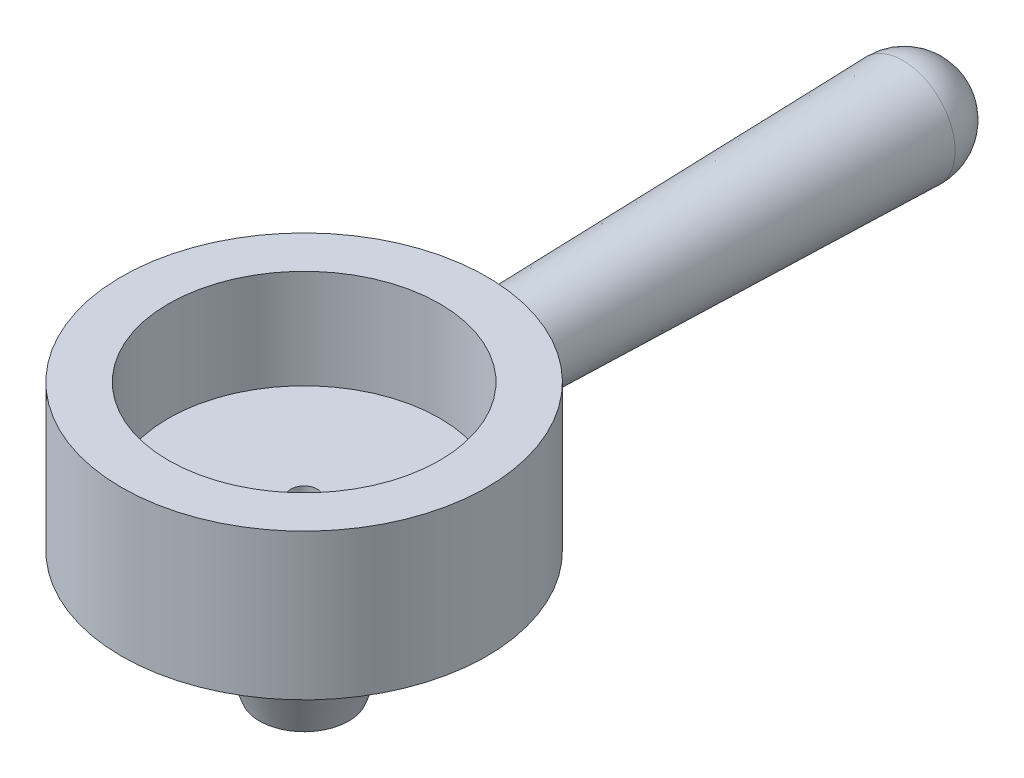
ISO-10303-21;
HEADER;
FILE_DESCRIPTION(('STEP AP214'),'2;1');
FILE_NAME('part.step','',(''),(''),'','','');
FILE_SCHEMA(('AUTOMOTIVE_DESIGN { 1 0 10303 214 1 1 1 1 }'));
ENDSEC;
DATA;
#1=APPLICATION_CONTEXT('core data for automotive mechanical design processes');
#2=APPLICATION_PROTOCOL_DEFINITION('international standard','automotive_design',2000,#1);
#3=PRODUCT_CONTEXT('',#1,'mechanical');
#4=PRODUCT('Part','Part','',(#3));
#5=PRODUCT_RELATED_PRODUCT_CATEGORY('part','',(#4));
#6=PRODUCT_DEFINITION_FORMATION('','',#4);
#7=PRODUCT_DEFINITION_CONTEXT('part definition',#1,'design');
#8=PRODUCT_DEFINITION('design','',#6,#7);
#9=PRODUCT_DEFINITION_SHAPE('','',#8);
#10=(LENGTH_UNIT() NAMED_UNIT(*) SI_UNIT(.MILLI.,.METRE.));
#11=(NAMED_UNIT(*) PLANE_ANGLE_UNIT() SI_UNIT($,.RADIAN.));
#12=(NAMED_UNIT(*) SI_UNIT($,.STERADIAN.) SOLID_ANGLE_UNIT());
#13=UNCERTAINTY_MEASURE_WITH_UNIT(LENGTH_MEASURE(1.E-05),#10,'distance_accuracy_value','');
#14=(GEOMETRIC_REPRESENTATION_CONTEXT(3) GLOBAL_UNCERTAINTY_ASSIGNED_CONTEXT((#13)) GLOBAL_UNIT_ASSIGNED_CONTEXT((#10,
#11,#12)) REPRESENTATION_CONTEXT('',''));
#15=CARTESIAN_POINT('',(0.,0.,0.));
#16=DIRECTION('',(0.,0.,1.));
#17=DIRECTION('',(1.,0.,0.));
#18=AXIS2_PLACEMENT_3D('',#15,#16,#17);
#19=CARTESIAN_POINT('',(144.,207.,-31.));
#20=DIRECTION('',(0.,-1.,0.));
#21=DIRECTION('',(0.,0.,-1.));
#22=AXIS2_PLACEMENT_3D('',#19,#20,#21);
#23=CYLINDRICAL_SURFACE('',#22,26.);
#24=CARTESIAN_POINT('',(144.,207.,-31.));
#25=DIRECTION('',(0.,1.,0.));
#26=DIRECTION('',(1.,0.,0.));
#27=AXIS2_PLACEMENT_3D('',#24,#25,#26);
#28=CIRCLE('',#27,26.);
#29=CARTESIAN_POINT('',(170.,207.,-31.));
#30=VERTEX_POINT('',#29);
#31=EDGE_CURVE('E60',#30,#30,#28,.T.);
#32=ORIENTED_EDGE('',*,*,#31,.T.);
#33=EDGE_LOOP('',(#32));
#34=FACE_BOUND('',#33,.T.);
#35=CARTESIAN_POINT('',(144.,188.,-31.));
#36=DIRECTION('',(0.,-1.,0.));
#37=DIRECTION('',(0.,0.,-1.));
#38=AXIS2_PLACEMENT_3D('',#35,#36,#37);
#39=CIRCLE('',#38,26.);
#40=CARTESIAN_POINT('',(144.,188.,-57.));
#41=VERTEX_POINT('',#40);
#42=EDGE_CURVE('E62',#41,#41,#39,.T.);
#43=ORIENTED_EDGE('',*,*,#42,.T.);
#44=EDGE_LOOP('',(#43));
#45=FACE_BOUND('',#44,.T.);
#46=ADVANCED_FACE('F33',(#34,#45),#23,.F.);
#47=CARTESIAN_POINT('',(144.,207.,-31.));
#48=DIRECTION('',(0.,1.,0.));
#49=DIRECTION('',(0.,0.,1.));
#50=AXIS2_PLACEMENT_3D('',#47,#48,#49);
#51=PLANE('',#50);
#52=CARTESIAN_POINT('',(144.,207.,-31.));
#53=DIRECTION('',(0.,1.,0.));
#54=DIRECTION('',(0.,0.,1.));
#55=AXIS2_PLACEMENT_3D('',#52,#53,#54);
#56=CIRCLE('',#55,35.);
#57=CARTESIAN_POINT('',(144.,207.,4.));
#58=VERTEX_POINT('',#57);
#59=EDGE_CURVE('E49',#58,#58,#56,.T.);
#60=ORIENTED_EDGE('',*,*,#59,.T.);
#61=EDGE_LOOP('',(#60));
#62=FACE_BOUND('',#61,.T.);
#63=ORIENTED_EDGE('',*,*,#31,.F.);
#64=EDGE_LOOP('',(#63));
#65=FACE_BOUND('',#64,.T.);
#66=ADVANCED_FACE('F101',(#62,#65),#51,.T.);
#67=CARTESIAN_POINT('',(144.,179.,-31.));
#68=DIRECTION('',(0.,1.,0.));
#69=DIRECTION('',(0.,0.,1.));
#70=AXIS2_PLACEMENT_3D('',#67,#68,#69);
#71=PLANE('',#70);
#72=CARTESIAN_POINT('',(144.,179.,-31.));
#73=DIRECTION('',(0.,-1.,0.));
#74=DIRECTION('',(0.,0.,-1.));
#75=AXIS2_PLACEMENT_3D('',#72,#73,#74);
#76=CIRCLE('',#75,10.);
#77=CARTESIAN_POINT('',(144.,179.,-41.));
#78=VERTEX_POINT('',#77);
#79=EDGE_CURVE('E45',#78,#78,#76,.T.);
#80=ORIENTED_EDGE('',*,*,#79,.F.);
#81=EDGE_LOOP('',(#80));
#82=FACE_BOUND('',#81,.T.);
#83=CARTESIAN_POINT('',(144.,179.,-31.));
#84=DIRECTION('',(0.,1.,0.));
#85=DIRECTION('',(0.,0.,1.));
#86=AXIS2_PLACEMENT_3D('',#83,#84,#85);
#87=CIRCLE('',#86,35.);
#88=CARTESIAN_POINT('',(144.,179.,4.));
#89=VERTEX_POINT('',#88);
#90=EDGE_CURVE('E54',#89,#89,#87,.T.);
#91=ORIENTED_EDGE('',*,*,#90,.F.);
#92=EDGE_LOOP('',(#91));
#93=FACE_BOUND('',#92,.T.);
#94=ADVANCED_FACE('F107',(#82,#93),#71,.F.);
#95=CARTESIAN_POINT('',(144.,207.,-31.));
#96=DIRECTION('',(0.,-1.,0.));
#97=DIRECTION('',(0.,0.,-1.));
#98=AXIS2_PLACEMENT_3D('',#95,#96,#97);
#99=CYLINDRICAL_SURFACE('',#98,35.);
#100=CARTESIAN_POINT('',(138.341114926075,187.328869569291,-65.5394994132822));
#101=CARTESIAN_POINT('',(138.499131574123,187.170282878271,-65.5653890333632));
#102=CARTESIAN_POINT('',(138.663759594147,187.018368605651,-65.5912469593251));
#103=CARTESIAN_POINT('',(139.005280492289,186.728770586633,-65.6422078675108));
#104=CARTESIAN_POINT('',(139.182174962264,186.591088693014,-65.6673107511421));
#105=CARTESIAN_POINT('',(139.547077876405,186.330932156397,-65.7160680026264));
#106=CARTESIAN_POINT('',(139.735089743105,186.208462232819,-65.7397219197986));
#107=CARTESIAN_POINT('',(140.121018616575,185.979606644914,-65.7849285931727));
#108=CARTESIAN_POINT('',(140.318939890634,185.873227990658,-65.8064804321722));
#109=CARTESIAN_POINT('',(140.723421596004,185.677347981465,-65.84688464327));
#110=CARTESIAN_POINT('',(140.929988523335,185.587859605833,-65.8657349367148));
#111=CARTESIAN_POINT('',(141.350086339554,185.426600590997,-65.900176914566));
#112=CARTESIAN_POINT('',(141.563614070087,185.354822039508,-65.9157700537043));
#113=CARTESIAN_POINT('',(141.996192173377,185.229517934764,-65.9432642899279));
#114=CARTESIAN_POINT('',(142.215242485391,185.175992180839,-65.9551654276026));
#115=CARTESIAN_POINT('',(142.657261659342,185.08764535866,-65.9749337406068));
#116=CARTESIAN_POINT('',(142.880230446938,185.052823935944,-65.9828009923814));
#117=CARTESIAN_POINT('',(143.324309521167,185.002650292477,-65.9941690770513));
#118=CARTESIAN_POINT('',(143.545378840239,184.986952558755,-65.9977473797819));
#119=CARTESIAN_POINT('',(143.988084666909,184.974002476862,-66.0006979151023));
#120=CARTESIAN_POINT('',(144.209721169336,184.976749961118,-66.0000701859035));
#121=CARTESIAN_POINT('',(144.65193662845,185.00066635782,-65.9946263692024));
#122=CARTESIAN_POINT('',(144.872515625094,185.021834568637,-65.9898104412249));
#123=CARTESIAN_POINT('',(145.3110253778,185.082412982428,-65.9761251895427));
#124=CARTESIAN_POINT('',(145.528956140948,185.121823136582,-65.9672558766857));
#125=CARTESIAN_POINT('',(145.958135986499,185.218003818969,-65.945834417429));
#126=CARTESIAN_POINT('',(146.169433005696,185.274570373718,-65.9333256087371));
#127=CARTESIAN_POINT('',(146.586538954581,185.404786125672,-65.9049212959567));
#128=CARTESIAN_POINT('',(146.792345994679,185.478441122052,-65.8890246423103));
#129=CARTESIAN_POINT('',(147.19696316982,185.642238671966,-65.8542773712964));
#130=CARTESIAN_POINT('',(147.395775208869,185.732376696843,-65.8354275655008));
#131=CARTESIAN_POINT('',(147.78523346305,185.928526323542,-65.7952633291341));
#132=CARTESIAN_POINT('',(147.975876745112,186.034543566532,-65.7739480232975));
#133=CARTESIAN_POINT('',(148.3509208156,186.263643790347,-65.7290335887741));
#134=CARTESIAN_POINT('',(148.535156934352,186.386989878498,-65.7054013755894));
#135=CARTESIAN_POINT('',(148.892652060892,186.648446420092,-65.6568103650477));
#136=CARTESIAN_POINT('',(149.065910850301,186.786557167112,-65.6318515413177));
#137=CARTESIAN_POINT('',(149.400384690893,187.076645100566,-65.581273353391));
#138=CARTESIAN_POINT('',(149.561596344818,187.228626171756,-65.5556538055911));
#139=CARTESIAN_POINT('',(149.870838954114,187.545366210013,-65.5044607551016));
#140=CARTESIAN_POINT('',(150.0188739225,187.710121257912,-65.4788872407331));
#141=CARTESIAN_POINT('',(150.303958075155,188.055130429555,-65.4279180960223));
#142=CARTESIAN_POINT('',(150.440694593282,188.235645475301,-65.4025387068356));
#143=CARTESIAN_POINT('',(150.698507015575,188.607723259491,-65.3532710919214));
#144=CARTESIAN_POINT('',(150.819583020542,188.799285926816,-65.3293828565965));
#145=CARTESIAN_POINT('',(151.045210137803,189.192158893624,-65.2837901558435));
#146=CARTESIAN_POINT('',(151.149761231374,189.393469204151,-65.2620856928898));
#147=CARTESIAN_POINT('',(151.34155717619,189.804440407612,-65.2215013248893));
#148=CARTESIAN_POINT('',(151.428802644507,190.014101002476,-65.2026213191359));
#149=CARTESIAN_POINT('',(151.584971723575,190.439362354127,-65.1683270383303));
#150=CARTESIAN_POINT('',(151.653974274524,190.654932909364,-65.1528978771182));
#151=CARTESIAN_POINT('',(151.77358718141,191.091268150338,-65.1258714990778));
#152=CARTESIAN_POINT('',(151.824204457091,191.312030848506,-65.1142728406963));
#153=CARTESIAN_POINT('',(151.906668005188,191.757225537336,-65.0952547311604));
#154=CARTESIAN_POINT('',(151.938513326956,191.981657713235,-65.0878354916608));
#155=CARTESIAN_POINT('',(151.983159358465,192.432508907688,-65.0774074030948));
#156=CARTESIAN_POINT('',(151.99596040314,192.65892789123,-65.0743984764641));
#157=CARTESIAN_POINT('',(152.002338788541,193.107054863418,-65.0729009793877));
#158=CARTESIAN_POINT('',(151.996333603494,193.328756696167,-65.0743142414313));
#159=CARTESIAN_POINT('',(151.966050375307,193.770917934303,-65.0814067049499));
#160=CARTESIAN_POINT('',(151.941766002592,193.991376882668,-65.0870873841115));
#161=CARTESIAN_POINT('',(151.87512118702,194.429351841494,-65.1025458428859));
#162=CARTESIAN_POINT('',(151.832764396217,194.646868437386,-65.1123227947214));
#163=CARTESIAN_POINT('',(151.73031147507,195.077478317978,-65.135685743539));
#164=CARTESIAN_POINT('',(151.670214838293,195.290571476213,-65.1492718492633));
#165=CARTESIAN_POINT('',(151.532922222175,195.710323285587,-65.1798187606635));
#166=CARTESIAN_POINT('',(151.455769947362,195.91699687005,-65.1967709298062));
#167=CARTESIAN_POINT('',(151.284850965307,196.323087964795,-65.2335885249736));
#168=CARTESIAN_POINT('',(151.191083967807,196.522505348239,-65.2534540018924));
#169=CARTESIAN_POINT('',(150.987612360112,196.912758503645,-65.2955399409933));
#170=CARTESIAN_POINT('',(150.877908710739,197.103594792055,-65.3177602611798));
#171=CARTESIAN_POINT('',(150.643275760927,197.475527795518,-65.3639517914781));
#172=CARTESIAN_POINT('',(150.518341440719,197.656621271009,-65.3879235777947));
#173=CARTESIAN_POINT('',(150.251353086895,198.011501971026,-65.4374707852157));
#174=CARTESIAN_POINT('',(150.108996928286,198.185058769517,-65.4630691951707));
#175=CARTESIAN_POINT('',(149.810270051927,198.519593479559,-65.514688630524));
#176=CARTESIAN_POINT('',(149.653899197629,198.680571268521,-65.540709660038));
#177=CARTESIAN_POINT('',(149.328135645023,198.988905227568,-65.5924582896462));
#178=CARTESIAN_POINT('',(149.158739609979,199.136257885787,-65.6181858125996));
#179=CARTESIAN_POINT('',(148.808138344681,199.416232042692,-65.6686191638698));
#180=CARTESIAN_POINT('',(148.626937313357,199.548858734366,-65.6933253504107));
#181=CARTESIAN_POINT('',(148.25189568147,199.799822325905,-65.7412937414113));
#182=CARTESIAN_POINT('',(148.057941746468,199.917993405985,-65.7645379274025));
#183=CARTESIAN_POINT('',(147.660541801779,200.137465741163,-65.808625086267));
#184=CARTESIAN_POINT('',(147.457099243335,200.238773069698,-65.8294689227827));
#185=CARTESIAN_POINT('',(147.042064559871,200.423784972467,-65.8681699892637));
#186=CARTESIAN_POINT('',(146.830471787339,200.507488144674,-65.8860269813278));
#187=CARTESIAN_POINT('',(146.400675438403,200.65659766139,-65.9182357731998));
#188=CARTESIAN_POINT('',(146.182471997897,200.722004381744,-65.9325876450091));
#189=CARTESIAN_POINT('',(145.745144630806,200.832934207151,-65.9571386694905));
#190=CARTESIAN_POINT('',(145.526112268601,200.87880249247,-65.9674096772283));
#191=CARTESIAN_POINT('',(145.084821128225,200.951996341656,-65.9838807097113));
#192=CARTESIAN_POINT('',(144.862562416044,200.979322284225,-65.9900808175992));
#193=CARTESIAN_POINT('',(144.416482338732,201.015196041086,-65.9982328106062));
#194=CARTESIAN_POINT('',(144.192661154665,201.023745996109,-66.0001851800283));
#195=CARTESIAN_POINT('',(143.745097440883,201.021999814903,-65.9997871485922));
#196=CARTESIAN_POINT('',(143.52135491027,201.011703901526,-65.9974367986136));
#197=CARTESIAN_POINT('',(143.080252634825,200.972766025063,-65.9885940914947));
#198=CARTESIAN_POINT('',(142.862856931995,200.944510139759,-65.982188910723));
#199=CARTESIAN_POINT('',(142.431197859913,200.870234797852,-65.9654905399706));
#200=CARTESIAN_POINT('',(142.216935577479,200.824209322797,-65.9551960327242));
#201=CARTESIAN_POINT('',(141.793183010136,200.714784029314,-65.9310032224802));
#202=CARTESIAN_POINT('',(141.583691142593,200.651390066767,-65.9171061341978));
#203=CARTESIAN_POINT('',(141.170753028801,200.507689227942,-65.8860753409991));
#204=CARTESIAN_POINT('',(140.967309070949,200.427376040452,-65.8689404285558));
#205=CARTESIAN_POINT('',(140.566600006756,200.249880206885,-65.8317745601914));
#206=CARTESIAN_POINT('',(140.369383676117,200.152591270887,-65.8117254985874));
#207=CARTESIAN_POINT('',(139.983755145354,199.942184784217,-65.7693460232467));
#208=CARTESIAN_POINT('',(139.795346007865,199.829061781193,-65.7470148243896));
#209=CARTESIAN_POINT('',(139.428622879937,199.58781584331,-65.7006725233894));
#210=CARTESIAN_POINT('',(139.250308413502,199.459693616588,-65.6766615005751));
#211=CARTESIAN_POINT('',(138.904890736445,199.189314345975,-65.6275944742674));
#212=CARTESIAN_POINT('',(138.737787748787,199.047057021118,-65.602538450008));
#213=CARTESIAN_POINT('',(138.411856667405,198.745655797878,-65.5514187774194));
#214=CARTESIAN_POINT('',(138.253335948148,198.586180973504,-65.525345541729));
#215=CARTESIAN_POINT('',(137.950276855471,198.254506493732,-65.4735330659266));
#216=CARTESIAN_POINT('',(137.805733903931,198.082311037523,-65.4477937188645));
#217=CARTESIAN_POINT('',(137.531485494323,197.726222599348,-65.3973512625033));
#218=CARTESIAN_POINT('',(137.401786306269,197.542324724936,-65.3726485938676));
#219=CARTESIAN_POINT('',(137.158240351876,197.164197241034,-65.325001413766));
#220=CARTESIAN_POINT('',(137.044387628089,196.969971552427,-65.302056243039));
#221=CARTESIAN_POINT('',(136.832429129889,196.570808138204,-65.2583966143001));
#222=CARTESIAN_POINT('',(136.734459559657,196.365795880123,-65.2377019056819));
#223=CARTESIAN_POINT('',(136.556177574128,195.948041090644,-65.1993833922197));
#224=CARTESIAN_POINT('',(136.475858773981,195.735301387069,-65.1817584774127));
#225=CARTESIAN_POINT('',(136.333462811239,195.303528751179,-65.1501029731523));
#226=CARTESIAN_POINT('',(136.271386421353,195.084495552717,-65.1360725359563));
#227=CARTESIAN_POINT('',(136.165988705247,194.641746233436,-65.1120388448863));
#228=CARTESIAN_POINT('',(136.122666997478,194.418030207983,-65.1020355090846));
#229=CARTESIAN_POINT('',(136.055788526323,193.971894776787,-65.0865172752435));
#230=CARTESIAN_POINT('',(136.031869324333,193.749532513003,-65.0809201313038));
#231=CARTESIAN_POINT('',(136.002621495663,193.303521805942,-65.074068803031));
#232=CARTESIAN_POINT('',(135.997292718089,193.07987337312,-65.0728145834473));
#233=CARTESIAN_POINT('',(136.005270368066,192.632918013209,-65.0746872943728));
#234=CARTESIAN_POINT('',(136.018577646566,192.40961110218,-65.0778144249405));
#235=CARTESIAN_POINT('',(136.063717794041,191.964983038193,-65.0883552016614));
#236=CARTESIAN_POINT('',(136.095550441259,191.743661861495,-65.0957687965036));
#237=CARTESIAN_POINT('',(136.176927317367,191.307563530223,-65.1145313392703));
#238=CARTESIAN_POINT('',(136.226227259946,191.092738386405,-65.1258259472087));
#239=CARTESIAN_POINT('',(136.342215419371,190.668065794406,-65.1520404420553));
#240=CARTESIAN_POINT('',(136.408903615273,190.45821834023,-65.1669603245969));
#241=CARTESIAN_POINT('',(136.559137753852,190.045006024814,-65.1999923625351));
#242=CARTESIAN_POINT('',(136.642676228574,189.84163833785,-65.2181031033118));
#243=CARTESIAN_POINT('',(136.825986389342,189.442689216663,-65.2570035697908));
#244=CARTESIAN_POINT('',(136.925756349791,189.247106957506,-65.2777930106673));
#245=CARTESIAN_POINT('',(137.211138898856,188.74012439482,-65.3357588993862));
#246=CARTESIAN_POINT('',(137.410284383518,188.436428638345,-65.374776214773));
#247=CARTESIAN_POINT('',(137.847565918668,187.858966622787,-65.4557229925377));
#248=CARTESIAN_POINT('',(138.085703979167,187.585201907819,-65.4976526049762));
#249=CARTESIAN_POINT('',(138.341114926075,187.328869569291,-65.5394994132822));
#250=B_SPLINE_CURVE_WITH_KNOTS('',3,(#100,#101,#102,#103,#104,#105,#106,#107,#108,#109,#110,
#111,#112,#113,#114,#115,#116,#117,#118,#119,#120,#121,#122,#123,#124,#125,#126,#127,#128,#129,
#130,#131,#132,#133,#134,#135,#136,#137,#138,#139,#140,#141,#142,#143,#144,#145,#146,#147,#148,
#149,#150,#151,#152,#153,#154,#155,#156,#157,#158,#159,#160,#161,#162,#163,#164,#165,#166,#167,
#168,#169,#170,#171,#172,#173,#174,#175,#176,#177,#178,#179,#180,#181,#182,#183,#184,#185,#186,
#187,#188,#189,#190,#191,#192,#193,#194,#195,#196,#197,#198,#199,#200,#201,#202,#203,#204,#205,
#206,#207,#208,#209,#210,#211,#212,#213,#214,#215,#216,#217,#218,#219,#220,#221,#222,#223,#224,
#225,#226,#227,#228,#229,#230,#231,#232,#233,#234,#235,#236,#237,#238,#239,#240,#241,#242,#243,
#244,#245,#246,#247,#248,#249),.UNSPECIFIED.,.T.,.F.,(4,2,2,2,2,2,2,2,2,2,2,2,2,2,2,2,2,2,2,2,2,
2,2,2,2,2,2,2,2,2,2,2,2,2,2,2,2,2,2,2,2,2,2,2,2,2,2,2,2,2,2,2,2,2,2,2,2,2,2,2,2,2,2,2,2,2,2,2,2,
2,2,2,2,2,4),(0.,0.675789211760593,1.35166628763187,2.02775252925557,2.70413246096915,
3.38103005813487,4.057624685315,4.73421187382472,5.41078624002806,6.07494627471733,
6.7391002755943,7.4032289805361,8.06735590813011,8.72387747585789,9.38062216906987,
10.037186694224,10.6939850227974,11.3621263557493,12.0302809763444,12.6986233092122,
13.3667613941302,14.0495729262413,14.7323800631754,15.415187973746,16.0979715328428,
16.7777503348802,17.4572730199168,18.1368301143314,18.8163752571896,19.4809431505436,
20.1457412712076,20.8104051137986,21.4750879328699,22.1380868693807,22.8010973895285,
23.4640679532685,24.1272576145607,24.8042464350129,25.4812418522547,26.1584112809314,
26.8353411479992,27.5194245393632,28.2032610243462,28.8871519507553,29.5710288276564,
30.2422649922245,30.9134874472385,31.5846333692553,32.2557713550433,32.9129487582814,
33.5703489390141,34.227527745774,34.884952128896,35.5466510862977,36.2085784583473,
36.8704745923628,37.5323838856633,38.2106838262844,38.8887608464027,39.5671232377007,
40.2452299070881,40.9288748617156,41.6122721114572,42.2956983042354,42.9791105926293,
43.649442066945,44.3197681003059,44.9901247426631,45.6604733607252,46.3217947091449,
46.9831152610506,47.6441433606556,48.305101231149,49.39735995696,50.4896750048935),.UNSPECIFIED.);
#251=CARTESIAN_POINT('',(138.341114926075,187.328869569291,-65.5394994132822));
#252=VERTEX_POINT('',#251);
#253=EDGE_CURVE('E10',#252,#252,#250,.T.);
#254=ORIENTED_EDGE('',*,*,#253,.T.);
#255=EDGE_LOOP('',(#254));
#256=FACE_BOUND('',#255,.T.);
#257=ORIENTED_EDGE('',*,*,#90,.T.);
#258=EDGE_LOOP('',(#257));
#259=FACE_BOUND('',#258,.T.);
#260=ORIENTED_EDGE('',*,*,#59,.F.);
#261=EDGE_LOOP('',(#260));
#262=FACE_BOUND('',#261,.T.);
#263=ADVANCED_FACE('F35',(#256,#259,#262),#99,.T.);
#264=CARTESIAN_POINT('',(144.,188.,-31.));
#265=DIRECTION('',(0.,-1.,0.));
#266=DIRECTION('',(0.,0.,-1.));
#267=AXIS2_PLACEMENT_3D('',#264,#265,#266);
#268=PLANE('',#267);
#269=CARTESIAN_POINT('',(144.,188.,-31.));
#270=DIRECTION('',(0.,-1.,0.));
#271=DIRECTION('',(0.,0.,-1.));
#272=AXIS2_PLACEMENT_3D('',#269,#270,#271);
#273=CIRCLE('',#272,2.5);
#274=CARTESIAN_POINT('',(144.,188.,-33.5));
#275=VERTEX_POINT('',#274);
#276=EDGE_CURVE('E77',#275,#275,#273,.F.);
#277=ORIENTED_EDGE('',*,*,#276,.F.);
#278=EDGE_LOOP('',(#277));
#279=FACE_BOUND('',#278,.T.);
#280=ORIENTED_EDGE('',*,*,#42,.F.);
#281=EDGE_LOOP('',(#280));
#282=FACE_BOUND('',#281,.T.);
#283=ADVANCED_FACE('F111',(#279,#282),#268,.F.);
#284=CARTESIAN_POINT('',(144.,170.,-31.));
#285=DIRECTION('',(0.,1.,0.));
#286=DIRECTION('',(0.,0.,1.));
#287=AXIS2_PLACEMENT_3D('',#284,#285,#286);
#288=CYLINDRICAL_SURFACE('',#287,10.);
#289=CARTESIAN_POINT('',(144.,170.,-31.));
#290=DIRECTION('',(0.,-1.,0.));
#291=DIRECTION('',(0.,0.,-1.));
#292=AXIS2_PLACEMENT_3D('',#289,#290,#291);
#293=CIRCLE('',#292,10.);
#294=CARTESIAN_POINT('',(144.,170.,-41.));
#295=VERTEX_POINT('',#294);
#296=EDGE_CURVE('E58',#295,#295,#293,.T.);
#297=ORIENTED_EDGE('',*,*,#296,.F.);
#298=EDGE_LOOP('',(#297));
#299=FACE_BOUND('',#298,.T.);
#300=ORIENTED_EDGE('',*,*,#79,.T.);
#301=EDGE_LOOP('',(#300));
#302=FACE_BOUND('',#301,.T.);
#303=ADVANCED_FACE('F128',(#299,#302),#288,.T.);
#304=CARTESIAN_POINT('',(144.,170.,-31.));
#305=DIRECTION('',(0.,1.,0.));
#306=DIRECTION('',(0.,0.,-1.));
#307=AXIS2_PLACEMENT_3D('',#304,#305,#306);
#308=CONICAL_SURFACE('',#307,14.,0.349065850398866);
#309=CARTESIAN_POINT('',(144.,155.,-31.));
#310=DIRECTION('',(0.,-1.,0.));
#311=DIRECTION('',(0.,0.,-1.));
#312=AXIS2_PLACEMENT_3D('',#309,#310,#311);
#313=CIRCLE('',#312,8.54044648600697);
#314=CARTESIAN_POINT('',(144.,155.,-39.540446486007));
#315=VERTEX_POINT('',#314);
#316=EDGE_CURVE('E69',#315,#315,#313,.T.);
#317=ORIENTED_EDGE('',*,*,#316,.F.);
#318=EDGE_LOOP('',(#317));
#319=FACE_BOUND('',#318,.T.);
#320=CARTESIAN_POINT('',(144.,170.,-31.));
#321=DIRECTION('',(0.,-1.,0.));
#322=DIRECTION('',(0.,0.,-1.));
#323=AXIS2_PLACEMENT_3D('',#320,#321,#322);
#324=CIRCLE('',#323,14.);
#325=CARTESIAN_POINT('',(144.,170.,-45.));
#326=VERTEX_POINT('',#325);
#327=EDGE_CURVE('E73',#326,#326,#324,.T.);
#328=ORIENTED_EDGE('',*,*,#327,.T.);
#329=EDGE_LOOP('',(#328));
#330=FACE_BOUND('',#329,.T.);
#331=ADVANCED_FACE('F133',(#319,#330),#308,.T.);
#332=CARTESIAN_POINT('',(144.,155.,-31.));
#333=DIRECTION('',(0.,-1.,0.));
#334=DIRECTION('',(0.,0.,-1.));
#335=AXIS2_PLACEMENT_3D('',#332,#333,#334);
#336=PLANE('',#335);
#337=CARTESIAN_POINT('',(144.,155.,-31.));
#338=DIRECTION('',(0.,-1.,0.));
#339=DIRECTION('',(0.,0.,-1.));
#340=AXIS2_PLACEMENT_3D('',#337,#338,#339);
#341=CIRCLE('',#340,2.5);
#342=CARTESIAN_POINT('',(144.,155.,-33.5));
#343=VERTEX_POINT('',#342);
#344=EDGE_CURVE('E82',#343,#343,#341,.T.);
#345=ORIENTED_EDGE('',*,*,#344,.F.);
#346=EDGE_LOOP('',(#345));
#347=FACE_BOUND('',#346,.T.);
#348=ORIENTED_EDGE('',*,*,#316,.T.);
#349=EDGE_LOOP('',(#348));
#350=FACE_BOUND('',#349,.T.);
#351=ADVANCED_FACE('F144',(#347,#350),#336,.T.);
#352=CARTESIAN_POINT('',(144.,170.,-31.));
#353=DIRECTION('',(0.,-1.,0.));
#354=DIRECTION('',(0.,0.,-1.));
#355=AXIS2_PLACEMENT_3D('',#352,#353,#354);
#356=PLANE('',#355);
#357=ORIENTED_EDGE('',*,*,#296,.T.);
#358=EDGE_LOOP('',(#357));
#359=FACE_BOUND('',#358,.T.);
#360=ORIENTED_EDGE('',*,*,#327,.F.);
#361=EDGE_LOOP('',(#360));
#362=FACE_BOUND('',#361,.T.);
#363=ADVANCED_FACE('F139',(#359,#362),#356,.F.);
#364=CARTESIAN_POINT('',(144.,280.001,-31.));
#365=DIRECTION('',(0.,-1.,0.));
#366=DIRECTION('',(0.,0.,-1.));
#367=AXIS2_PLACEMENT_3D('',#364,#365,#366);
#368=CYLINDRICAL_SURFACE('',#367,2.5);
#369=ORIENTED_EDGE('',*,*,#344,.T.);
#370=EDGE_LOOP('',(#369));
#371=FACE_BOUND('',#370,.T.);
#372=ORIENTED_EDGE('',*,*,#276,.T.);
#373=EDGE_LOOP('',(#372));
#374=FACE_BOUND('',#373,.T.);
#375=ADVANCED_FACE('F98',(#371,#374),#368,.F.);
#376=CARTESIAN_POINT('',(144.,193.,-65.0734500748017));
#377=DIRECTION('',(0.,0.,-1.));
#378=DIRECTION('',(-1.,0.,0.));
#379=AXIS2_PLACEMENT_3D('',#376,#377,#378);
#380=CONICAL_SURFACE('',#379,8.00000000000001,0.0247465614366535);
#381=CARTESIAN_POINT('',(144.,193.,-145.752559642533));
#382=DIRECTION('',(0.,0.,1.));
#383=DIRECTION('',(1.,0.,0.));
#384=AXIS2_PLACEMENT_3D('',#381,#382,#383);
#385=CIRCLE('',#384,9.9969381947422);
#386=CARTESIAN_POINT('',(153.996938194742,193.,-145.752559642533));
#387=VERTEX_POINT('',#386);
#388=EDGE_CURVE('E85',#387,#387,#385,.T.);
#389=ORIENTED_EDGE('',*,*,#388,.T.);
#390=EDGE_LOOP('',(#389));
#391=FACE_BOUND('',#390,.T.);
#392=ORIENTED_EDGE('',*,*,#253,.F.);
#393=EDGE_LOOP('',(#392));
#394=FACE_BOUND('',#393,.T.);
#395=ADVANCED_FACE('F89',(#391,#394),#380,.T.);
#396=CARTESIAN_POINT('',(144.,193.,-146.));
#397=DIRECTION('',(0.,0.,1.));
#398=DIRECTION('',(1.,0.,0.));
#399=AXIS2_PLACEMENT_3D('',#396,#397,#398);
#400=SPHERICAL_SURFACE('',#399,9.99999999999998);
#401=ORIENTED_EDGE('',*,*,#388,.F.);
#402=EDGE_LOOP('',(#401));
#403=FACE_BOUND('',#402,.T.);
#404=ADVANCED_FACE('F92',(#403),#400,.T.);
#405=CLOSED_SHELL('',(#46,#66,#94,#263,#283,#303,#331,#351,#363,#375,#395,#404));
#406=MANIFOLD_SOLID_BREP('B2',#405);
#407=ADVANCED_BREP_SHAPE_REPRESENTATION('',(#18,#406),#14);
#408=SHAPE_DEFINITION_REPRESENTATION(#9,#407);
ENDSEC;
END-ISO-10303-21;
